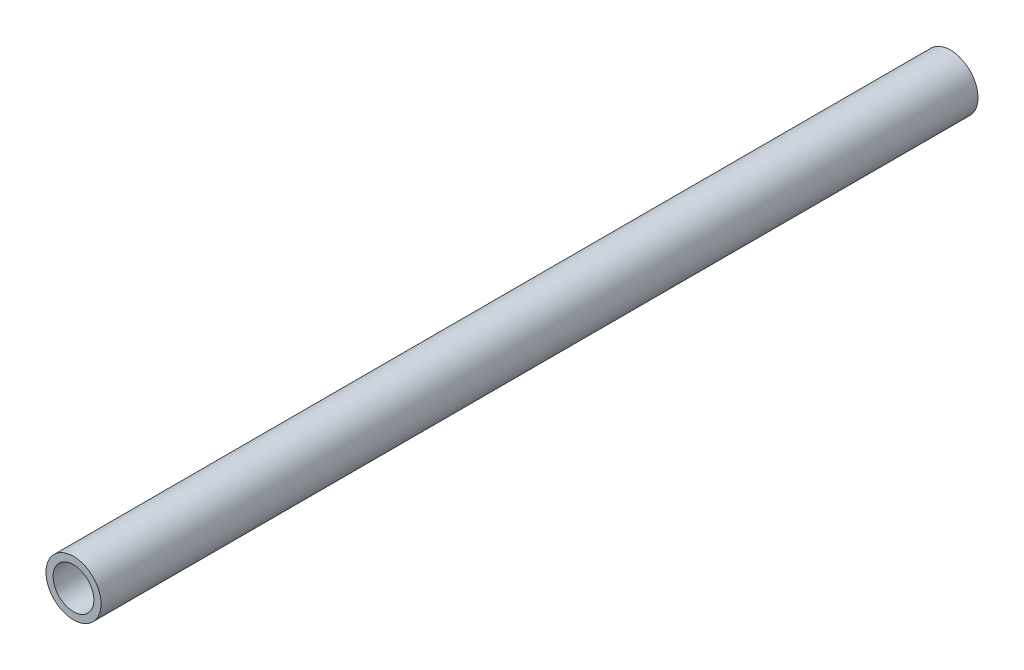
from build123d import *

# Parameters (mm, degrees)
SKETCH1_R           = 8.5725
SKETCH1_R_2         = 6.35
BOSS_EXTRUDE1_DEPTH = 273.05


with BuildPart() as part:
    # Sketch1 → Boss-Extrude1 (new body)
    with BuildSketch(Plane.XY):
        Circle(SKETCH1_R)
        Circle(SKETCH1_R_2, mode=Mode.SUBTRACT)
    extrude(amount=BOSS_EXTRUDE1_DEPTH)


solid = part.part
